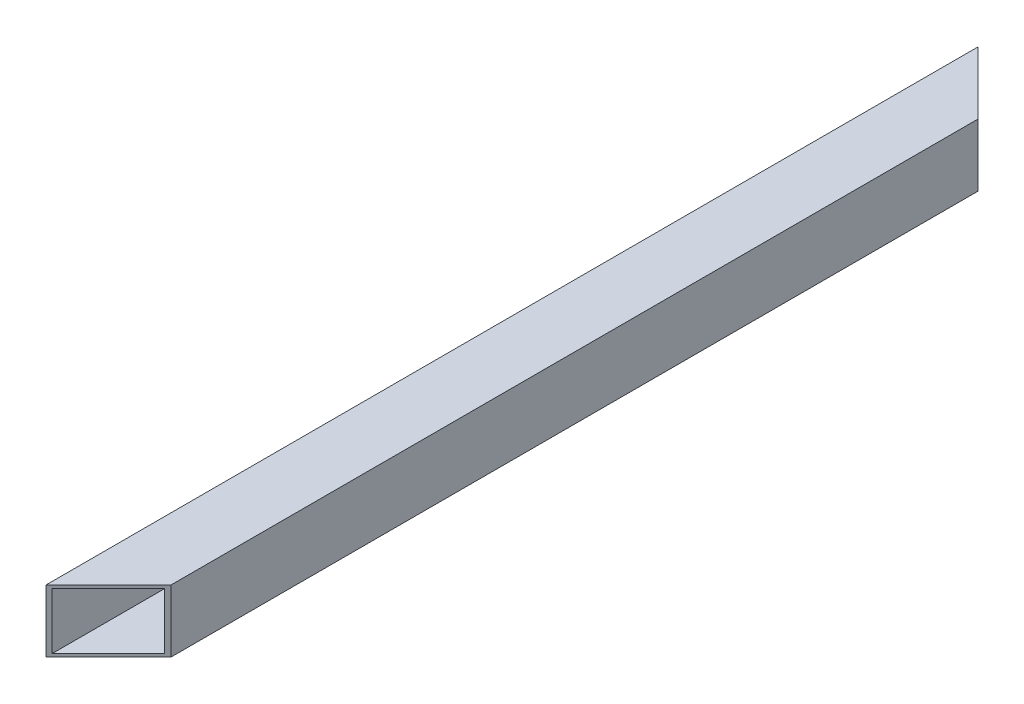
ISO-10303-21;
HEADER;
FILE_DESCRIPTION(('STEP AP214'),'2;1');
FILE_NAME('part.step','',(''),(''),'','','');
FILE_SCHEMA(('AUTOMOTIVE_DESIGN { 1 0 10303 214 1 1 1 1 }'));
ENDSEC;
DATA;
#1=APPLICATION_CONTEXT('core data for automotive mechanical design processes');
#2=APPLICATION_PROTOCOL_DEFINITION('international standard','automotive_design',2000,#1);
#3=PRODUCT_CONTEXT('',#1,'mechanical');
#4=PRODUCT('Part','Part','',(#3));
#5=PRODUCT_RELATED_PRODUCT_CATEGORY('part','',(#4));
#6=PRODUCT_DEFINITION_FORMATION('','',#4);
#7=PRODUCT_DEFINITION_CONTEXT('part definition',#1,'design');
#8=PRODUCT_DEFINITION('design','',#6,#7);
#9=PRODUCT_DEFINITION_SHAPE('','',#8);
#10=(LENGTH_UNIT() NAMED_UNIT(*) SI_UNIT(.MILLI.,.METRE.));
#11=(NAMED_UNIT(*) PLANE_ANGLE_UNIT() SI_UNIT($,.RADIAN.));
#12=(NAMED_UNIT(*) SI_UNIT($,.STERADIAN.) SOLID_ANGLE_UNIT());
#13=UNCERTAINTY_MEASURE_WITH_UNIT(LENGTH_MEASURE(1.E-05),#10,'distance_accuracy_value','');
#14=(GEOMETRIC_REPRESENTATION_CONTEXT(3) GLOBAL_UNCERTAINTY_ASSIGNED_CONTEXT((#13)) GLOBAL_UNIT_ASSIGNED_CONTEXT((#10,
#11,#12)) REPRESENTATION_CONTEXT('',''));
#15=CARTESIAN_POINT('',(0.,0.,0.));
#16=DIRECTION('',(0.,0.,1.));
#17=DIRECTION('',(1.,0.,0.));
#18=AXIS2_PLACEMENT_3D('',#15,#16,#17);
#19=CARTESIAN_POINT('',(-36.,36.,-40.));
#20=DIRECTION('',(1.,0.,0.));
#21=DIRECTION('',(0.,1.,0.));
#22=AXIS2_PLACEMENT_3D('',#19,#20,#21);
#23=PLANE('',#22);
#24=DIRECTION('',(0.,-1.,0.));
#25=VECTOR('',#24,1.);
#26=CARTESIAN_POINT('',(-36.,18.,-36.));
#27=LINE('',#26,#25);
#28=CARTESIAN_POINT('',(-36.,36.,-36.));
#29=VERTEX_POINT('',#28);
#30=CARTESIAN_POINT('',(-36.,-36.,-36.));
#31=VERTEX_POINT('',#30);
#32=EDGE_CURVE('E283',#29,#31,#27,.T.);
#33=ORIENTED_EDGE('',*,*,#32,.F.);
#34=DIRECTION('',(0.,0.,1.));
#35=VECTOR('',#34,1.);
#36=CARTESIAN_POINT('',(-36.,36.,-40.));
#37=LINE('',#36,#35);
#38=CARTESIAN_POINT('',(-36.,36.,1149.138438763));
#39=VERTEX_POINT('',#38);
#40=EDGE_CURVE('E10',#29,#39,#37,.T.);
#41=ORIENTED_EDGE('',*,*,#40,.T.);
#42=DIRECTION('',(0.,1.,0.));
#43=VECTOR('',#42,1.);
#44=CARTESIAN_POINT('',(-36.,18.,1149.138438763));
#45=LINE('',#44,#43);
#46=CARTESIAN_POINT('',(-36.,-36.,1149.138438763));
#47=VERTEX_POINT('',#46);
#48=EDGE_CURVE('E112',#47,#39,#45,.T.);
#49=ORIENTED_EDGE('',*,*,#48,.F.);
#50=DIRECTION('',(0.,0.,1.));
#51=VECTOR('',#50,1.);
#52=CARTESIAN_POINT('',(-36.,-36.,-40.));
#53=LINE('',#52,#51);
#54=EDGE_CURVE('E93',#31,#47,#53,.T.);
#55=ORIENTED_EDGE('',*,*,#54,.F.);
#56=EDGE_LOOP('',(#33,#41,#49,#55));
#57=FACE_BOUND('',#56,.T.);
#58=ADVANCED_FACE('F16',(#57),#23,.T.);
#59=CARTESIAN_POINT('',(36.,36.,-40.));
#60=DIRECTION('',(0.,-1.,0.));
#61=DIRECTION('',(0.,0.,-1.));
#62=AXIS2_PLACEMENT_3D('',#59,#60,#61);
#63=PLANE('',#62);
#64=DIRECTION('',(-0.707106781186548,0.,-0.707106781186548));
#65=VECTOR('',#64,1.);
#66=CARTESIAN_POINT('',(-1.,36.,-1.));
#67=LINE('',#66,#65);
#68=CARTESIAN_POINT('',(36.,36.,36.));
#69=VERTEX_POINT('',#68);
#70=EDGE_CURVE('E279',#69,#29,#67,.T.);
#71=ORIENTED_EDGE('',*,*,#70,.F.);
#72=DIRECTION('',(0.,0.,1.));
#73=VECTOR('',#72,1.);
#74=CARTESIAN_POINT('',(36.,36.,-40.));
#75=LINE('',#74,#73);
#76=CARTESIAN_POINT('',(36.,36.,1077.138438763));
#77=VERTEX_POINT('',#76);
#78=EDGE_CURVE('E24',#69,#77,#75,.T.);
#79=ORIENTED_EDGE('',*,*,#78,.T.);
#80=DIRECTION('',(0.707106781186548,0.,-0.707106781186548));
#81=VECTOR('',#80,1.);
#82=CARTESIAN_POINT('',(575.56921938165,36.,537.56921938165));
#83=LINE('',#82,#81);
#84=EDGE_CURVE('E117',#39,#77,#83,.T.);
#85=ORIENTED_EDGE('',*,*,#84,.F.);
#86=ORIENTED_EDGE('',*,*,#40,.F.);
#87=EDGE_LOOP('',(#71,#79,#85,#86));
#88=FACE_BOUND('',#87,.T.);
#89=ADVANCED_FACE('F176',(#88),#63,.T.);
#90=CARTESIAN_POINT('',(36.,-36.,-40.));
#91=DIRECTION('',(-1.,0.,0.));
#92=DIRECTION('',(0.,0.,1.));
#93=AXIS2_PLACEMENT_3D('',#90,#91,#92);
#94=PLANE('',#93);
#95=DIRECTION('',(0.,1.,0.));
#96=VECTOR('',#95,1.);
#97=CARTESIAN_POINT('',(36.,-18.,36.));
#98=LINE('',#97,#96);
#99=CARTESIAN_POINT('',(36.,-36.,36.));
#100=VERTEX_POINT('',#99);
#101=EDGE_CURVE('E273',#100,#69,#98,.T.);
#102=ORIENTED_EDGE('',*,*,#101,.F.);
#103=DIRECTION('',(0.,0.,1.));
#104=VECTOR('',#103,1.);
#105=CARTESIAN_POINT('',(36.,-36.,-40.));
#106=LINE('',#105,#104);
#107=CARTESIAN_POINT('',(36.,-36.,1077.138438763));
#108=VERTEX_POINT('',#107);
#109=EDGE_CURVE('E36',#100,#108,#106,.T.);
#110=ORIENTED_EDGE('',*,*,#109,.T.);
#111=DIRECTION('',(0.,-1.,0.));
#112=VECTOR('',#111,1.);
#113=CARTESIAN_POINT('',(36.,-18.,1077.138438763));
#114=LINE('',#113,#112);
#115=EDGE_CURVE('E113',#77,#108,#114,.T.);
#116=ORIENTED_EDGE('',*,*,#115,.F.);
#117=ORIENTED_EDGE('',*,*,#78,.F.);
#118=EDGE_LOOP('',(#102,#110,#116,#117));
#119=FACE_BOUND('',#118,.T.);
#120=ADVANCED_FACE('F181',(#119),#94,.T.);
#121=CARTESIAN_POINT('',(-36.,-36.,-40.));
#122=DIRECTION('',(0.,1.,0.));
#123=DIRECTION('',(1.,0.,0.));
#124=AXIS2_PLACEMENT_3D('',#121,#122,#123);
#125=PLANE('',#124);
#126=DIRECTION('',(0.707106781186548,0.,0.707106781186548));
#127=VECTOR('',#126,1.);
#128=CARTESIAN_POINT('',(-19.,-36.,-19.));
#129=LINE('',#128,#127);
#130=EDGE_CURVE('E99',#31,#100,#129,.T.);
#131=ORIENTED_EDGE('',*,*,#130,.F.);
#132=ORIENTED_EDGE('',*,*,#54,.T.);
#133=DIRECTION('',(-0.707106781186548,0.,0.707106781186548));
#134=VECTOR('',#133,1.);
#135=CARTESIAN_POINT('',(557.56921938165,-36.,555.56921938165));
#136=LINE('',#135,#134);
#137=EDGE_CURVE('E96',#108,#47,#136,.T.);
#138=ORIENTED_EDGE('',*,*,#137,.F.);
#139=ORIENTED_EDGE('',*,*,#109,.F.);
#140=EDGE_LOOP('',(#131,#132,#138,#139));
#141=FACE_BOUND('',#140,.T.);
#142=ADVANCED_FACE('F95',(#141),#125,.T.);
#143=CARTESIAN_POINT('',(40.,40.,-40.));
#144=DIRECTION('',(0.,-1.,0.));
#145=DIRECTION('',(0.,0.,-1.));
#146=AXIS2_PLACEMENT_3D('',#143,#144,#145);
#147=PLANE('',#146);
#148=DIRECTION('',(0.,0.,1.));
#149=VECTOR('',#148,1.);
#150=CARTESIAN_POINT('',(-40.,40.,-40.));
#151=LINE('',#150,#149);
#152=CARTESIAN_POINT('',(-40.,40.,-40.));
#153=VERTEX_POINT('',#152);
#154=CARTESIAN_POINT('',(-40.,40.,1153.1384388));
#155=VERTEX_POINT('',#154);
#156=EDGE_CURVE('E105',#153,#155,#151,.T.);
#157=ORIENTED_EDGE('',*,*,#156,.T.);
#158=DIRECTION('',(0.707106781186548,0.,-0.707106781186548));
#159=VECTOR('',#158,1.);
#160=CARTESIAN_POINT('',(576.56921938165,40.,536.56921938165));
#161=LINE('',#160,#159);
#162=CARTESIAN_POINT('',(40.,40.,1073.138438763));
#163=VERTEX_POINT('',#162);
#164=EDGE_CURVE('E126',#155,#163,#161,.T.);
#165=ORIENTED_EDGE('',*,*,#164,.T.);
#166=DIRECTION('',(0.,0.,1.));
#167=VECTOR('',#166,1.);
#168=CARTESIAN_POINT('',(40.,40.,-40.));
#169=LINE('',#168,#167);
#170=CARTESIAN_POINT('',(40.,40.,40.));
#171=VERTEX_POINT('',#170);
#172=EDGE_CURVE('E240',#171,#163,#169,.T.);
#173=ORIENTED_EDGE('',*,*,#172,.F.);
#174=DIRECTION('',(-0.707106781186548,0.,-0.707106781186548));
#175=VECTOR('',#174,1.);
#176=CARTESIAN_POINT('',(0.,40.,0.));
#177=LINE('',#176,#175);
#178=EDGE_CURVE('E260',#171,#153,#177,.T.);
#179=ORIENTED_EDGE('',*,*,#178,.T.);
#180=EDGE_LOOP('',(#157,#165,#173,#179));
#181=FACE_BOUND('',#180,.T.);
#182=ADVANCED_FACE('F148',(#181),#147,.F.);
#183=CARTESIAN_POINT('',(-40.,40.,-40.));
#184=DIRECTION('',(1.,0.,0.));
#185=DIRECTION('',(0.,1.,0.));
#186=AXIS2_PLACEMENT_3D('',#183,#184,#185);
#187=PLANE('',#186);
#188=DIRECTION('',(0.,-1.,0.));
#189=VECTOR('',#188,1.);
#190=CARTESIAN_POINT('',(-40.,40.,-40.));
#191=LINE('',#190,#189);
#192=CARTESIAN_POINT('',(-40.,-40.,-40.));
#193=VERTEX_POINT('',#192);
#194=EDGE_CURVE('E257',#153,#193,#191,.T.);
#195=ORIENTED_EDGE('',*,*,#194,.T.);
#196=DIRECTION('',(0.,0.,1.));
#197=VECTOR('',#196,1.);
#198=CARTESIAN_POINT('',(-40.,-40.,-40.));
#199=LINE('',#198,#197);
#200=CARTESIAN_POINT('',(-40.,-40.,1153.1384388));
#201=VERTEX_POINT('',#200);
#202=EDGE_CURVE('E248',#193,#201,#199,.T.);
#203=ORIENTED_EDGE('',*,*,#202,.T.);
#204=DIRECTION('',(0.,-1.,0.));
#205=VECTOR('',#204,1.);
#206=CARTESIAN_POINT('',(-40.,40.,1153.1384388));
#207=LINE('',#206,#205);
#208=EDGE_CURVE('E118',#155,#201,#207,.T.);
#209=ORIENTED_EDGE('',*,*,#208,.F.);
#210=ORIENTED_EDGE('',*,*,#156,.F.);
#211=EDGE_LOOP('',(#195,#203,#209,#210));
#212=FACE_BOUND('',#211,.T.);
#213=ADVANCED_FACE('F143',(#212),#187,.F.);
#214=CARTESIAN_POINT('',(556.56921938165,0.,556.56921938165));
#215=DIRECTION('',(-0.707106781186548,0.,-0.707106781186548));
#216=DIRECTION('',(-0.707106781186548,0.,0.707106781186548));
#217=AXIS2_PLACEMENT_3D('',#214,#215,#216);
#218=PLANE('',#217);
#219=ORIENTED_EDGE('',*,*,#48,.T.);
#220=ORIENTED_EDGE('',*,*,#84,.T.);
#221=ORIENTED_EDGE('',*,*,#115,.T.);
#222=ORIENTED_EDGE('',*,*,#137,.T.);
#223=EDGE_LOOP('',(#219,#220,#221,#222));
#224=FACE_BOUND('',#223,.T.);
#225=DIRECTION('',(-0.707106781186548,0.,0.707106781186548));
#226=VECTOR('',#225,1.);
#227=CARTESIAN_POINT('',(556.56921938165,-40.,556.56921938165));
#228=LINE('',#227,#226);
#229=CARTESIAN_POINT('',(40.,-40.,1073.138438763));
#230=VERTEX_POINT('',#229);
#231=EDGE_CURVE('E243',#230,#201,#228,.T.);
#232=ORIENTED_EDGE('',*,*,#231,.F.);
#233=DIRECTION('',(0.,-1.,0.));
#234=VECTOR('',#233,1.);
#235=CARTESIAN_POINT('',(40.,-20.,1073.138438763));
#236=LINE('',#235,#234);
#237=EDGE_CURVE('E130',#163,#230,#236,.T.);
#238=ORIENTED_EDGE('',*,*,#237,.F.);
#239=ORIENTED_EDGE('',*,*,#164,.F.);
#240=ORIENTED_EDGE('',*,*,#208,.T.);
#241=EDGE_LOOP('',(#232,#238,#239,#240));
#242=FACE_BOUND('',#241,.T.);
#243=ADVANCED_FACE('F109',(#224,#242),#218,.F.);
#244=CARTESIAN_POINT('',(40.,-40.,-40.));
#245=DIRECTION('',(-1.,0.,0.));
#246=DIRECTION('',(0.,0.,1.));
#247=AXIS2_PLACEMENT_3D('',#244,#245,#246);
#248=PLANE('',#247);
#249=ORIENTED_EDGE('',*,*,#172,.T.);
#250=ORIENTED_EDGE('',*,*,#237,.T.);
#251=DIRECTION('',(0.,0.,1.));
#252=VECTOR('',#251,1.);
#253=CARTESIAN_POINT('',(40.,-40.,-40.));
#254=LINE('',#253,#252);
#255=CARTESIAN_POINT('',(40.,-40.,40.));
#256=VERTEX_POINT('',#255);
#257=EDGE_CURVE('E239',#256,#230,#254,.T.);
#258=ORIENTED_EDGE('',*,*,#257,.F.);
#259=DIRECTION('',(0.,1.,0.));
#260=VECTOR('',#259,1.);
#261=CARTESIAN_POINT('',(40.,-20.,40.));
#262=LINE('',#261,#260);
#263=EDGE_CURVE('E261',#256,#171,#262,.T.);
#264=ORIENTED_EDGE('',*,*,#263,.T.);
#265=EDGE_LOOP('',(#249,#250,#258,#264));
#266=FACE_BOUND('',#265,.T.);
#267=ADVANCED_FACE('F170',(#266),#248,.F.);
#268=CARTESIAN_POINT('',(0.,0.,0.));
#269=DIRECTION('',(-0.707106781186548,0.,0.707106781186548));
#270=DIRECTION('',(0.,1.,0.));
#271=AXIS2_PLACEMENT_3D('',#268,#269,#270);
#272=PLANE('',#271);
#273=ORIENTED_EDGE('',*,*,#101,.T.);
#274=ORIENTED_EDGE('',*,*,#70,.T.);
#275=ORIENTED_EDGE('',*,*,#32,.T.);
#276=ORIENTED_EDGE('',*,*,#130,.T.);
#277=EDGE_LOOP('',(#273,#274,#275,#276));
#278=FACE_BOUND('',#277,.T.);
#279=ORIENTED_EDGE('',*,*,#263,.F.);
#280=DIRECTION('',(0.707106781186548,0.,0.707106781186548));
#281=VECTOR('',#280,1.);
#282=CARTESIAN_POINT('',(-20.,-40.,-20.));
#283=LINE('',#282,#281);
#284=EDGE_CURVE('E252',#193,#256,#283,.T.);
#285=ORIENTED_EDGE('',*,*,#284,.F.);
#286=ORIENTED_EDGE('',*,*,#194,.F.);
#287=ORIENTED_EDGE('',*,*,#178,.F.);
#288=EDGE_LOOP('',(#279,#285,#286,#287));
#289=FACE_BOUND('',#288,.T.);
#290=ADVANCED_FACE('F161',(#278,#289),#272,.F.);
#291=CARTESIAN_POINT('',(-40.,-40.,-40.));
#292=DIRECTION('',(0.,1.,0.));
#293=DIRECTION('',(1.,0.,0.));
#294=AXIS2_PLACEMENT_3D('',#291,#292,#293);
#295=PLANE('',#294);
#296=ORIENTED_EDGE('',*,*,#257,.T.);
#297=ORIENTED_EDGE('',*,*,#231,.T.);
#298=ORIENTED_EDGE('',*,*,#202,.F.);
#299=ORIENTED_EDGE('',*,*,#284,.T.);
#300=EDGE_LOOP('',(#296,#297,#298,#299));
#301=FACE_BOUND('',#300,.T.);
#302=ADVANCED_FACE('F156',(#301),#295,.F.);
#303=CLOSED_SHELL('',(#58,#89,#120,#142,#182,#213,#243,#267,#290,#302));
#304=MANIFOLD_SOLID_BREP('B1',#303);
#305=ADVANCED_BREP_SHAPE_REPRESENTATION('',(#18,#304),#14);
#306=SHAPE_DEFINITION_REPRESENTATION(#9,#305);
ENDSEC;
END-ISO-10303-21;
